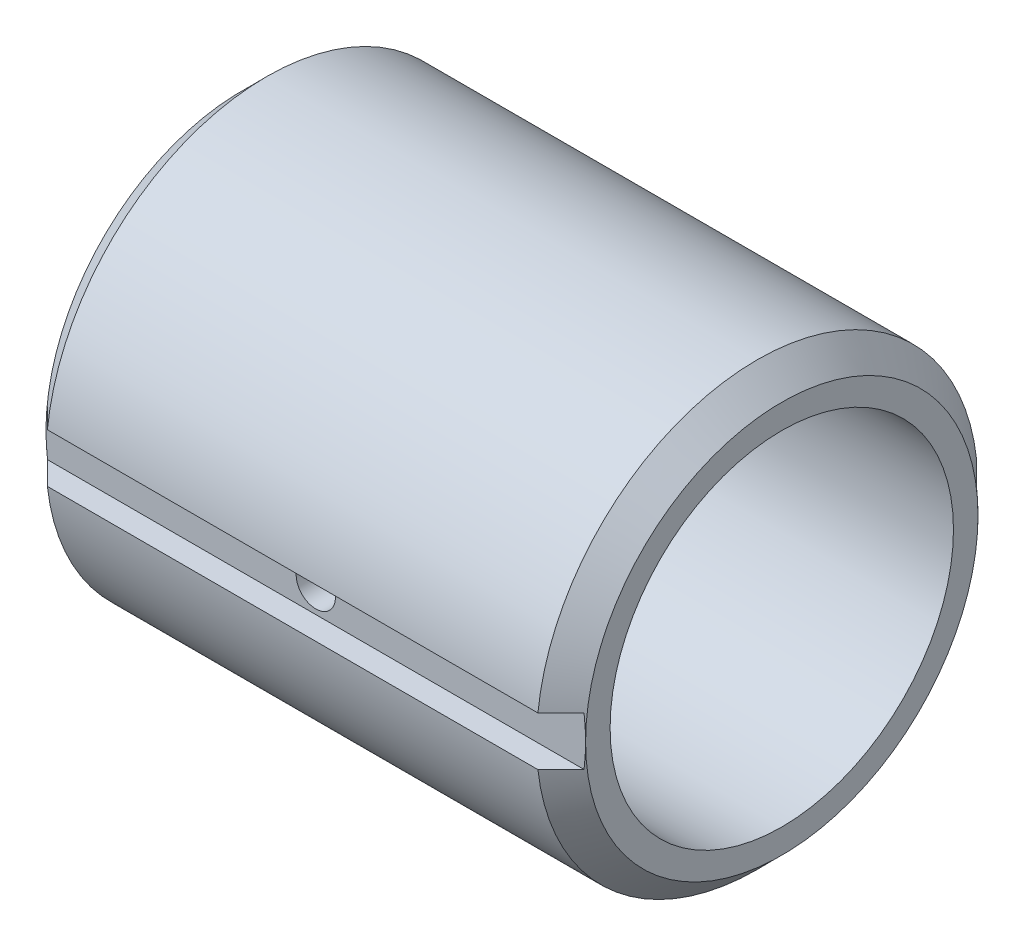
ISO-10303-21;
HEADER;
FILE_DESCRIPTION(('STEP AP214'),'2;1');
FILE_NAME('part.step','',(''),(''),'','','');
FILE_SCHEMA(('AUTOMOTIVE_DESIGN { 1 0 10303 214 1 1 1 1 }'));
ENDSEC;
DATA;
#1=APPLICATION_CONTEXT('core data for automotive mechanical design processes');
#2=APPLICATION_PROTOCOL_DEFINITION('international standard','automotive_design',2000,#1);
#3=PRODUCT_CONTEXT('',#1,'mechanical');
#4=PRODUCT('Part','Part','',(#3));
#5=PRODUCT_RELATED_PRODUCT_CATEGORY('part','',(#4));
#6=PRODUCT_DEFINITION_FORMATION('','',#4);
#7=PRODUCT_DEFINITION_CONTEXT('part definition',#1,'design');
#8=PRODUCT_DEFINITION('design','',#6,#7);
#9=PRODUCT_DEFINITION_SHAPE('','',#8);
#10=(LENGTH_UNIT() NAMED_UNIT(*) SI_UNIT(.MILLI.,.METRE.));
#11=(NAMED_UNIT(*) PLANE_ANGLE_UNIT() SI_UNIT($,.RADIAN.));
#12=(NAMED_UNIT(*) SI_UNIT($,.STERADIAN.) SOLID_ANGLE_UNIT());
#13=UNCERTAINTY_MEASURE_WITH_UNIT(LENGTH_MEASURE(1.E-05),#10,'distance_accuracy_value','');
#14=(GEOMETRIC_REPRESENTATION_CONTEXT(3) GLOBAL_UNCERTAINTY_ASSIGNED_CONTEXT((#13)) GLOBAL_UNIT_ASSIGNED_CONTEXT((#10,
#11,#12)) REPRESENTATION_CONTEXT('',''));
#15=CARTESIAN_POINT('',(0.,0.,0.));
#16=DIRECTION('',(0.,0.,1.));
#17=DIRECTION('',(1.,0.,0.));
#18=AXIS2_PLACEMENT_3D('',#15,#16,#17);
#19=CARTESIAN_POINT('',(-56.7094648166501,-29.0186818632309,0.));
#20=DIRECTION('',(1.,0.,0.));
#21=DIRECTION('',(0.,1.,0.));
#22=AXIS2_PLACEMENT_3D('',#19,#20,#21);
#23=CONICAL_SURFACE('',#22,57.15,0.785398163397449);
#24=CARTESIAN_POINT('',(-47.729008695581,-22.6686818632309,65.8248792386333));
#25=CARTESIAN_POINT('',(-49.7175826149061,-22.6686818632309,63.8270278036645));
#26=CARTESIAN_POINT('',(-51.7057811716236,-22.6686818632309,61.8288023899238));
#27=CARTESIAN_POINT('',(-55.6810500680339,-22.6686818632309,57.831232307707));
#28=CARTESIAN_POINT('',(-57.6681204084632,-22.6686818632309,55.8318876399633));
#29=CARTESIAN_POINT('',(-61.6407587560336,-22.6686818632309,51.8317043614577));
#30=CARTESIAN_POINT('',(-63.6263267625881,-22.6686818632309,49.8308657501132));
#31=CARTESIAN_POINT('',(-66.6030645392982,-22.6686818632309,46.8280062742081));
#32=CARTESIAN_POINT('',(-67.5950417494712,-22.6686818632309,45.826785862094));
#33=CARTESIAN_POINT('',(-69.5783330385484,-22.6686818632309,43.8236882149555));
#34=CARTESIAN_POINT('',(-70.5696471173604,-22.6686818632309,42.8218109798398));
#35=CARTESIAN_POINT('',(-71.5605670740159,-22.6686818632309,41.8195438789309));
#36=B_SPLINE_CURVE_WITH_KNOTS('',3,(#24,#25,#26,#27,#28,#29,#30,#31,#32,#33,#34,#35),
.UNSPECIFIED.,.F.,.F.,(4,2,2,2,2,4),(0.,8.45650841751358,16.9130113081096,25.3695174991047,
29.5977733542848,33.8260297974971),.UNSPECIFIED.);
#37=CARTESIAN_POINT('',(-56.7094648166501,-22.6686818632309,56.7961266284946));
#38=VERTEX_POINT('',#37);
#39=CARTESIAN_POINT('',(-62.6641281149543,-22.6686818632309,50.8));
#40=VERTEX_POINT('',#39);
#41=EDGE_CURVE('E257',#38,#40,#36,.T.);
#42=ORIENTED_EDGE('',*,*,#41,.F.);
#43=CARTESIAN_POINT('',(-56.7094648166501,-29.0186818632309,0.));
#44=DIRECTION('',(1.,0.,0.));
#45=DIRECTION('',(0.,1.,0.));
#46=AXIS2_PLACEMENT_3D('',#43,#44,#45);
#47=CIRCLE('',#46,57.15);
#48=CARTESIAN_POINT('',(-56.7094648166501,-22.6686818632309,-56.7961266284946));
#49=VERTEX_POINT('',#48);
#50=EDGE_CURVE('E148',#49,#38,#47,.T.);
#51=ORIENTED_EDGE('',*,*,#50,.F.);
#52=CARTESIAN_POINT('',(-71.5605670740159,-22.6686818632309,-41.8195438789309));
#53=CARTESIAN_POINT('',(-70.5696471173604,-22.6686818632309,-42.8218109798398));
#54=CARTESIAN_POINT('',(-69.5783330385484,-22.6686818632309,-43.8236882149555));
#55=CARTESIAN_POINT('',(-67.5950417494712,-22.6686818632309,-45.826785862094));
#56=CARTESIAN_POINT('',(-66.6030645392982,-22.6686818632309,-46.8280062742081));
#57=CARTESIAN_POINT('',(-63.6263267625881,-22.6686818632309,-49.8308657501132));
#58=CARTESIAN_POINT('',(-61.6407587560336,-22.6686818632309,-51.8317043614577));
#59=CARTESIAN_POINT('',(-57.6681204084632,-22.6686818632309,-55.8318876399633));
#60=CARTESIAN_POINT('',(-55.6810500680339,-22.6686818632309,-57.831232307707));
#61=CARTESIAN_POINT('',(-51.7057811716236,-22.6686818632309,-61.8288023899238));
#62=CARTESIAN_POINT('',(-49.7175826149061,-22.6686818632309,-63.8270278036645));
#63=CARTESIAN_POINT('',(-47.729008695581,-22.6686818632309,-65.8248792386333));
#64=B_SPLINE_CURVE_WITH_KNOTS('',3,(#52,#53,#54,#55,#56,#57,#58,#59,#60,#61,#62,#63),
.UNSPECIFIED.,.F.,.F.,(4,2,2,2,2,4),(0.,4.2282564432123,8.45651229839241,16.9130184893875,
25.3695213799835,33.8260297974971),.UNSPECIFIED.);
#65=CARTESIAN_POINT('',(-62.6641281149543,-22.6686818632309,-50.8));
#66=VERTEX_POINT('',#65);
#67=EDGE_CURVE('E137',#66,#49,#64,.T.);
#68=ORIENTED_EDGE('',*,*,#67,.F.);
#69=CARTESIAN_POINT('',(-59.0606425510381,-49.5679135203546,-50.8));
#70=CARTESIAN_POINT('',(-59.3683374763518,-48.7473884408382,-50.8));
#71=CARTESIAN_POINT('',(-59.6621813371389,-47.9215539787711,-50.8));
#72=CARTESIAN_POINT('',(-60.2193025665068,-46.2593389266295,-50.8));
#73=CARTESIAN_POINT('',(-60.4825693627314,-45.4229547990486,-50.8));
#74=CARTESIAN_POINT('',(-60.9760717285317,-43.7381767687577,-50.8));
#75=CARTESIAN_POINT('',(-61.2062231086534,-42.8897580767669,-50.8));
#76=CARTESIAN_POINT('',(-61.6296984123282,-41.1838379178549,-50.8));
#77=CARTESIAN_POINT('',(-61.8230262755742,-40.326337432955,-50.8));
#78=CARTESIAN_POINT('',(-62.1639644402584,-38.6336465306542,-50.8));
#79=CARTESIAN_POINT('',(-62.3129441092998,-37.7987328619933,-50.8));
#80=CARTESIAN_POINT('',(-62.571810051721,-36.1228256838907,-50.8));
#81=CARTESIAN_POINT('',(-62.6816957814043,-35.2818320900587,-50.8));
#82=CARTESIAN_POINT('',(-62.8604880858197,-33.5965360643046,-50.8));
#83=CARTESIAN_POINT('',(-62.9294454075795,-32.7522390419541,-50.8));
#84=CARTESIAN_POINT('',(-63.0254252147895,-31.061257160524,-50.8));
#85=CARTESIAN_POINT('',(-63.0524477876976,-30.2145723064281,-50.8));
#86=CARTESIAN_POINT('',(-63.0642758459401,-28.4928981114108,-50.8));
#87=CARTESIAN_POINT('',(-63.0476558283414,-27.6178985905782,-50.8));
#88=CARTESIAN_POINT('',(-62.969462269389,-25.8699080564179,-50.8));
#89=CARTESIAN_POINT('',(-62.9078878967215,-24.9969170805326,-50.8));
#90=CARTESIAN_POINT('',(-62.7407976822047,-23.2539905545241,-50.8));
#91=CARTESIAN_POINT('',(-62.6352230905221,-22.384060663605,-50.8));
#92=CARTESIAN_POINT('',(-62.3819682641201,-20.6504018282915,-50.8));
#93=CARTESIAN_POINT('',(-62.2342888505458,-19.7866727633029,-50.8));
#94=CARTESIAN_POINT('',(-61.8928995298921,-18.0346115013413,-50.8));
#95=CARTESIAN_POINT('',(-61.6976659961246,-17.1465772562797,-50.8));
#96=CARTESIAN_POINT('',(-61.2674829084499,-15.3801107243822,-50.8));
#97=CARTESIAN_POINT('',(-61.0325285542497,-14.5016796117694,-50.8));
#98=CARTESIAN_POINT('',(-60.5268806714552,-12.7577085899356,-50.8));
#99=CARTESIAN_POINT('',(-60.2562819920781,-11.8921410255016,-50.8));
#100=CARTESIAN_POINT('',(-59.6822657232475,-10.1723061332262,-50.8));
#101=CARTESIAN_POINT('',(-59.3788607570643,-9.31803459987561,-50.8));
#102=CARTESIAN_POINT('',(-59.0606425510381,-8.46945020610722,-50.8));
#103=B_SPLINE_CURVE_WITH_KNOTS('',3,(#69,#70,#71,#72,#73,#74,#75,#76,#77,#78,#79,#80,#81,#82,
#83,#84,#85,#86,#87,#88,#89,#90,#91,#92,#93,#94,#95,#96,#97,#98,#99,#100,#101,#102),
.UNSPECIFIED.,.F.,.F.,(4,2,2,2,2,2,2,2,2,2,2,2,2,2,2,2,4),(0.,2.628996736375,5.25889978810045,
7.89537499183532,10.5315679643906,13.0749956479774,15.6184587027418,18.1587615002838,
20.6990589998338,23.3233543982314,25.9476983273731,28.5755576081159,31.2033656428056,
33.9301044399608,36.657173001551,39.3771261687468,42.0960364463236),.UNSPECIFIED.);
#104=CARTESIAN_POINT('',(-63.0594648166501,-29.0186818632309,-50.8));
#105=VERTEX_POINT('',#104);
#106=EDGE_CURVE('E122',#105,#66,#103,.T.);
#107=ORIENTED_EDGE('',*,*,#106,.F.);
#108=CARTESIAN_POINT('',(-63.0594648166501,-29.0186818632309,0.));
#109=DIRECTION('',(1.,0.,0.));
#110=DIRECTION('',(0.,1.,0.));
#111=AXIS2_PLACEMENT_3D('',#108,#109,#110);
#112=CIRCLE('',#111,50.8);
#113=CARTESIAN_POINT('',(-63.0594648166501,-29.0186818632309,50.8));
#114=VERTEX_POINT('',#113);
#115=EDGE_CURVE('E279',#105,#114,#112,.T.);
#116=ORIENTED_EDGE('',*,*,#115,.T.);
#117=CARTESIAN_POINT('',(-59.0606425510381,-8.4694502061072,50.8));
#118=CARTESIAN_POINT('',(-59.3683374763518,-9.2899752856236,50.8));
#119=CARTESIAN_POINT('',(-59.6621813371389,-10.1158097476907,50.8));
#120=CARTESIAN_POINT('',(-60.2193025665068,-11.7780247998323,50.8));
#121=CARTESIAN_POINT('',(-60.4825693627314,-12.6144089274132,50.8));
#122=CARTESIAN_POINT('',(-60.9760717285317,-14.2991869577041,50.8));
#123=CARTESIAN_POINT('',(-61.2062231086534,-15.1476056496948,50.8));
#124=CARTESIAN_POINT('',(-61.6296984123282,-16.8535258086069,50.8));
#125=CARTESIAN_POINT('',(-61.8230262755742,-17.7110262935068,50.8));
#126=CARTESIAN_POINT('',(-62.1639644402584,-19.4037171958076,50.8));
#127=CARTESIAN_POINT('',(-62.3129441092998,-20.2386308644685,50.8));
#128=CARTESIAN_POINT('',(-62.571810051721,-21.9145380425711,50.8));
#129=CARTESIAN_POINT('',(-62.6816957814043,-22.7555316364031,50.8));
#130=CARTESIAN_POINT('',(-62.8604880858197,-24.4408276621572,50.8));
#131=CARTESIAN_POINT('',(-62.9294454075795,-25.2851246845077,50.8));
#132=CARTESIAN_POINT('',(-63.0254252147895,-26.9761065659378,50.8));
#133=CARTESIAN_POINT('',(-63.0524477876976,-27.8227914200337,50.8));
#134=CARTESIAN_POINT('',(-63.0642758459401,-29.544465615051,50.8));
#135=CARTESIAN_POINT('',(-63.0476558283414,-30.4194651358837,50.8));
#136=CARTESIAN_POINT('',(-62.969462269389,-32.1674556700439,50.8));
#137=CARTESIAN_POINT('',(-62.9078878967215,-33.0404466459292,50.8));
#138=CARTESIAN_POINT('',(-62.7407976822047,-34.7833731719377,50.8));
#139=CARTESIAN_POINT('',(-62.6352230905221,-35.6533030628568,50.8));
#140=CARTESIAN_POINT('',(-62.3819682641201,-37.3869618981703,50.8));
#141=CARTESIAN_POINT('',(-62.2342888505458,-38.2506909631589,50.8));
#142=CARTESIAN_POINT('',(-61.8928995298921,-40.0027522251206,50.8));
#143=CARTESIAN_POINT('',(-61.6976659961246,-40.8907864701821,50.8));
#144=CARTESIAN_POINT('',(-61.2674829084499,-42.6572530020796,50.8));
#145=CARTESIAN_POINT('',(-61.0325285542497,-43.5356841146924,50.8));
#146=CARTESIAN_POINT('',(-60.5268806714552,-45.2796551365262,50.8));
#147=CARTESIAN_POINT('',(-60.2562819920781,-46.1452227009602,50.8));
#148=CARTESIAN_POINT('',(-59.6822657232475,-47.8650575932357,50.8));
#149=CARTESIAN_POINT('',(-59.3788607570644,-48.7193291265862,50.8));
#150=CARTESIAN_POINT('',(-59.0606425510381,-49.5679135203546,50.8));
#151=B_SPLINE_CURVE_WITH_KNOTS('',3,(#117,#118,#119,#120,#121,#122,#123,#124,#125,#126,#127,
#128,#129,#130,#131,#132,#133,#134,#135,#136,#137,#138,#139,#140,#141,#142,#143,#144,#145,#146,
#147,#148,#149,#150),.UNSPECIFIED.,.F.,.F.,(4,2,2,2,2,2,2,2,2,2,2,2,2,2,2,2,4),(0.,
2.62899673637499,5.25889978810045,7.89537499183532,10.5315679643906,13.0749956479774,
15.6184587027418,18.1587615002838,20.6990589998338,23.3233543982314,25.9476983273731,
28.5755576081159,31.2033656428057,33.9301044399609,36.657173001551,39.3771261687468,
42.0960364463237),.UNSPECIFIED.);
#152=EDGE_CURVE('E300',#40,#114,#151,.T.);
#153=ORIENTED_EDGE('',*,*,#152,.F.);
#154=EDGE_LOOP('',(#42,#51,#68,#107,#116,#153));
#155=FACE_BOUND('',#154,.T.);
#156=ADVANCED_FACE('F39',(#155),#23,.T.);
#157=CARTESIAN_POINT('',(76.6405351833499,-29.0186818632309,0.));
#158=DIRECTION('',(1.,0.,0.));
#159=DIRECTION('',(0.,1.,0.));
#160=AXIS2_PLACEMENT_3D('',#157,#158,#159);
#161=CYLINDRICAL_SURFACE('',#160,57.15);
#162=DIRECTION('',(1.,0.,0.));
#163=VECTOR('',#162,1.);
#164=CARTESIAN_POINT('',(76.6405351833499,-22.6686818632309,56.7961266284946));
#165=LINE('',#164,#163);
#166=CARTESIAN_POINT('',(70.2905351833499,-22.6686818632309,56.7961266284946));
#167=VERTEX_POINT('',#166);
#168=EDGE_CURVE('E254',#167,#38,#165,.F.);
#169=ORIENTED_EDGE('',*,*,#168,.F.);
#170=CARTESIAN_POINT('',(70.2905351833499,-29.0186818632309,0.));
#171=DIRECTION('',(1.,0.,0.));
#172=DIRECTION('',(0.,1.,0.));
#173=AXIS2_PLACEMENT_3D('',#170,#171,#172);
#174=CIRCLE('',#173,57.15);
#175=CARTESIAN_POINT('',(70.2905351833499,-22.6686818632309,-56.7961266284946));
#176=VERTEX_POINT('',#175);
#177=EDGE_CURVE('E269',#176,#167,#174,.T.);
#178=ORIENTED_EDGE('',*,*,#177,.F.);
#179=DIRECTION('',(1.,0.,0.));
#180=VECTOR('',#179,1.);
#181=CARTESIAN_POINT('',(76.6405351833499,-22.6686818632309,-56.7961266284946));
#182=LINE('',#181,#180);
#183=EDGE_CURVE('E150',#49,#176,#182,.T.);
#184=ORIENTED_EDGE('',*,*,#183,.F.);
#185=ORIENTED_EDGE('',*,*,#50,.T.);
#186=EDGE_LOOP('',(#169,#178,#184,#185));
#187=FACE_BOUND('',#186,.T.);
#188=ADVANCED_FACE('F313',(#187),#161,.T.);
#189=CARTESIAN_POINT('',(76.6405351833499,-29.0186818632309,0.));
#190=DIRECTION('',(-1.,0.,0.));
#191=DIRECTION('',(0.,-1.,0.));
#192=AXIS2_PLACEMENT_3D('',#189,#190,#191);
#193=CONICAL_SURFACE('',#192,50.8,0.785398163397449);
#194=CARTESIAN_POINT('',(85.1416374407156,-22.6686818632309,41.8195438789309));
#195=CARTESIAN_POINT('',(84.1507174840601,-22.6686818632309,42.8218109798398));
#196=CARTESIAN_POINT('',(83.1594034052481,-22.6686818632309,43.8236882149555));
#197=CARTESIAN_POINT('',(81.1761121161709,-22.6686818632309,45.826785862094));
#198=CARTESIAN_POINT('',(80.1841349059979,-22.6686818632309,46.8280062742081));
#199=CARTESIAN_POINT('',(77.2073971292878,-22.6686818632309,49.8308657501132));
#200=CARTESIAN_POINT('',(75.2218291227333,-22.6686818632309,51.8317043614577));
#201=CARTESIAN_POINT('',(71.2491907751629,-22.6686818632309,55.8318876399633));
#202=CARTESIAN_POINT('',(69.2621204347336,-22.6686818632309,57.831232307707));
#203=CARTESIAN_POINT('',(65.2868515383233,-22.6686818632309,61.8288023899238));
#204=CARTESIAN_POINT('',(63.2986529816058,-22.6686818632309,63.8270278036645));
#205=CARTESIAN_POINT('',(61.3100790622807,-22.6686818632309,65.8248792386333));
#206=B_SPLINE_CURVE_WITH_KNOTS('',3,(#194,#195,#196,#197,#198,#199,#200,#201,#202,#203,#204,
#205),.UNSPECIFIED.,.F.,.F.,(4,2,2,2,2,4),(0.,4.2282564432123,8.45651229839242,16.9130184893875,
25.3695213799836,33.8260297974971),.UNSPECIFIED.);
#207=CARTESIAN_POINT('',(76.245198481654,-22.6686818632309,50.8));
#208=VERTEX_POINT('',#207);
#209=EDGE_CURVE('E11',#208,#167,#206,.T.);
#210=ORIENTED_EDGE('',*,*,#209,.F.);
#211=CARTESIAN_POINT('',(72.6417129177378,-49.5679135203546,50.8));
#212=CARTESIAN_POINT('',(72.9494078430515,-48.7473884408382,50.8));
#213=CARTESIAN_POINT('',(73.2432517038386,-47.9215539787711,50.8));
#214=CARTESIAN_POINT('',(73.8003729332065,-46.2593389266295,50.8));
#215=CARTESIAN_POINT('',(74.0636397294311,-45.4229547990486,50.8));
#216=CARTESIAN_POINT('',(74.5571420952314,-43.7381767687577,50.8));
#217=CARTESIAN_POINT('',(74.7872934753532,-42.889758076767,50.8));
#218=CARTESIAN_POINT('',(75.2107687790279,-41.1838379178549,50.8));
#219=CARTESIAN_POINT('',(75.4040966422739,-40.326337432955,50.8));
#220=CARTESIAN_POINT('',(75.7450348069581,-38.6336465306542,50.8));
#221=CARTESIAN_POINT('',(75.8940144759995,-37.7987328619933,50.8));
#222=CARTESIAN_POINT('',(76.1528804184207,-36.1228256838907,50.8));
#223=CARTESIAN_POINT('',(76.262766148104,-35.2818320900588,50.8));
#224=CARTESIAN_POINT('',(76.4415584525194,-33.5965360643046,50.8));
#225=CARTESIAN_POINT('',(76.5105157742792,-32.7522390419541,50.8));
#226=CARTESIAN_POINT('',(76.6064955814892,-31.061257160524,50.8));
#227=CARTESIAN_POINT('',(76.6335181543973,-30.2145723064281,50.8));
#228=CARTESIAN_POINT('',(76.6453462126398,-28.4928981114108,50.8));
#229=CARTESIAN_POINT('',(76.6287261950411,-27.6178985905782,50.8));
#230=CARTESIAN_POINT('',(76.5505326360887,-25.8699080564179,50.8));
#231=CARTESIAN_POINT('',(76.4889582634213,-24.9969170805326,50.8));
#232=CARTESIAN_POINT('',(76.3218680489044,-23.2539905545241,50.8));
#233=CARTESIAN_POINT('',(76.2162934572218,-22.384060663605,50.8));
#234=CARTESIAN_POINT('',(75.9630386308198,-20.6504018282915,50.8));
#235=CARTESIAN_POINT('',(75.8153592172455,-19.7866727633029,50.8));
#236=CARTESIAN_POINT('',(75.4739698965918,-18.0346115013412,50.8));
#237=CARTESIAN_POINT('',(75.2787363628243,-17.1465772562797,50.8));
#238=CARTESIAN_POINT('',(74.8485532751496,-15.3801107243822,50.8));
#239=CARTESIAN_POINT('',(74.6135989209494,-14.5016796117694,50.8));
#240=CARTESIAN_POINT('',(74.1079510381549,-12.7577085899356,50.8));
#241=CARTESIAN_POINT('',(73.8373523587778,-11.8921410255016,50.8));
#242=CARTESIAN_POINT('',(73.2633360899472,-10.1723061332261,50.8));
#243=CARTESIAN_POINT('',(72.9599311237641,-9.3180345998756,50.8));
#244=CARTESIAN_POINT('',(72.6417129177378,-8.4694502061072,50.8));
#245=B_SPLINE_CURVE_WITH_KNOTS('',3,(#211,#212,#213,#214,#215,#216,#217,#218,#219,#220,#221,
#222,#223,#224,#225,#226,#227,#228,#229,#230,#231,#232,#233,#234,#235,#236,#237,#238,#239,#240,
#241,#242,#243,#244),.UNSPECIFIED.,.F.,.F.,(4,2,2,2,2,2,2,2,2,2,2,2,2,2,2,2,4),(0.,
2.628996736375,5.25889978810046,7.89537499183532,10.5315679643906,13.0749956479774,
15.6184587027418,18.1587615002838,20.6990589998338,23.3233543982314,25.9476983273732,
28.575557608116,31.2033656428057,33.9301044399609,36.657173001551,39.3771261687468,
42.0960364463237),.UNSPECIFIED.);
#246=CARTESIAN_POINT('',(76.6405351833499,-29.0186818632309,50.8));
#247=VERTEX_POINT('',#246);
#248=EDGE_CURVE('E214',#247,#208,#245,.T.);
#249=ORIENTED_EDGE('',*,*,#248,.F.);
#250=CARTESIAN_POINT('',(76.6405351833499,-29.0186818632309,0.));
#251=DIRECTION('',(1.,0.,0.));
#252=DIRECTION('',(0.,1.,0.));
#253=AXIS2_PLACEMENT_3D('',#250,#251,#252);
#254=CIRCLE('',#253,50.8);
#255=CARTESIAN_POINT('',(76.6405351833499,-29.0186818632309,-50.8));
#256=VERTEX_POINT('',#255);
#257=EDGE_CURVE('E264',#256,#247,#254,.T.);
#258=ORIENTED_EDGE('',*,*,#257,.F.);
#259=CARTESIAN_POINT('',(72.6417129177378,-8.46945020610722,-50.8));
#260=CARTESIAN_POINT('',(72.9494078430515,-9.28997528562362,-50.8));
#261=CARTESIAN_POINT('',(73.2432517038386,-10.1158097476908,-50.8));
#262=CARTESIAN_POINT('',(73.8003729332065,-11.7780247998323,-50.8));
#263=CARTESIAN_POINT('',(74.0636397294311,-12.6144089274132,-50.8));
#264=CARTESIAN_POINT('',(74.5571420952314,-14.2991869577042,-50.8));
#265=CARTESIAN_POINT('',(74.7872934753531,-15.1476056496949,-50.8));
#266=CARTESIAN_POINT('',(75.2107687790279,-16.8535258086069,-50.8));
#267=CARTESIAN_POINT('',(75.4040966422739,-17.7110262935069,-50.8));
#268=CARTESIAN_POINT('',(75.7450348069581,-19.4037171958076,-50.8));
#269=CARTESIAN_POINT('',(75.8940144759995,-20.2386308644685,-50.8));
#270=CARTESIAN_POINT('',(76.1528804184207,-21.9145380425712,-50.8));
#271=CARTESIAN_POINT('',(76.262766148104,-22.7555316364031,-50.8));
#272=CARTESIAN_POINT('',(76.4415584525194,-24.4408276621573,-50.8));
#273=CARTESIAN_POINT('',(76.5105157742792,-25.2851246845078,-50.8));
#274=CARTESIAN_POINT('',(76.6064955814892,-26.9761065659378,-50.8));
#275=CARTESIAN_POINT('',(76.6335181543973,-27.8227914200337,-50.8));
#276=CARTESIAN_POINT('',(76.6453462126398,-29.5444656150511,-50.8));
#277=CARTESIAN_POINT('',(76.6287261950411,-30.4194651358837,-50.8));
#278=CARTESIAN_POINT('',(76.5505326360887,-32.1674556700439,-50.8));
#279=CARTESIAN_POINT('',(76.4889582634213,-33.0404466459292,-50.8));
#280=CARTESIAN_POINT('',(76.3218680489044,-34.7833731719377,-50.8));
#281=CARTESIAN_POINT('',(76.2162934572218,-35.6533030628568,-50.8));
#282=CARTESIAN_POINT('',(75.9630386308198,-37.3869618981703,-50.8));
#283=CARTESIAN_POINT('',(75.8153592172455,-38.2506909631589,-50.8));
#284=CARTESIAN_POINT('',(75.4739698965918,-40.0027522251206,-50.8));
#285=CARTESIAN_POINT('',(75.2787363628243,-40.8907864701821,-50.8));
#286=CARTESIAN_POINT('',(74.8485532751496,-42.6572530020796,-50.8));
#287=CARTESIAN_POINT('',(74.6135989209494,-43.5356841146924,-50.8));
#288=CARTESIAN_POINT('',(74.1079510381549,-45.2796551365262,-50.8));
#289=CARTESIAN_POINT('',(73.8373523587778,-46.1452227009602,-50.8));
#290=CARTESIAN_POINT('',(73.2633360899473,-47.8650575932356,-50.8));
#291=CARTESIAN_POINT('',(72.9599311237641,-48.7193291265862,-50.8));
#292=CARTESIAN_POINT('',(72.6417129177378,-49.5679135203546,-50.8));
#293=B_SPLINE_CURVE_WITH_KNOTS('',3,(#259,#260,#261,#262,#263,#264,#265,#266,#267,#268,#269,
#270,#271,#272,#273,#274,#275,#276,#277,#278,#279,#280,#281,#282,#283,#284,#285,#286,#287,#288,
#289,#290,#291,#292),.UNSPECIFIED.,.F.,.F.,(4,2,2,2,2,2,2,2,2,2,2,2,2,2,2,2,4),(0.,
2.62899673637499,5.25889978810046,7.89537499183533,10.5315679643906,13.0749956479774,
15.6184587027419,18.1587615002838,20.6990589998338,23.3233543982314,25.9476983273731,
28.5755576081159,31.2033656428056,33.9301044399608,36.657173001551,39.3771261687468,
42.0960364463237),.UNSPECIFIED.);
#294=CARTESIAN_POINT('',(76.245198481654,-22.6686818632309,-50.8));
#295=VERTEX_POINT('',#294);
#296=EDGE_CURVE('E70',#295,#256,#293,.T.);
#297=ORIENTED_EDGE('',*,*,#296,.F.);
#298=CARTESIAN_POINT('',(61.3100790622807,-22.6686818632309,-65.8248792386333));
#299=CARTESIAN_POINT('',(63.2986529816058,-22.6686818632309,-63.8270278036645));
#300=CARTESIAN_POINT('',(65.2868515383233,-22.6686818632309,-61.8288023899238));
#301=CARTESIAN_POINT('',(69.2621204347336,-22.6686818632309,-57.831232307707));
#302=CARTESIAN_POINT('',(71.2491907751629,-22.6686818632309,-55.8318876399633));
#303=CARTESIAN_POINT('',(75.2218291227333,-22.6686818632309,-51.8317043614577));
#304=CARTESIAN_POINT('',(77.2073971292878,-22.6686818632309,-49.8308657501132));
#305=CARTESIAN_POINT('',(80.1841349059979,-22.6686818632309,-46.8280062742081));
#306=CARTESIAN_POINT('',(81.1761121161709,-22.6686818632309,-45.826785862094));
#307=CARTESIAN_POINT('',(83.1594034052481,-22.6686818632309,-43.8236882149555));
#308=CARTESIAN_POINT('',(84.1507174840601,-22.6686818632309,-42.8218109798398));
#309=CARTESIAN_POINT('',(85.1416374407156,-22.6686818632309,-41.8195438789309));
#310=B_SPLINE_CURVE_WITH_KNOTS('',3,(#298,#299,#300,#301,#302,#303,#304,#305,#306,#307,#308,
#309),.UNSPECIFIED.,.F.,.F.,(4,2,2,2,2,4),(0.,8.45650841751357,16.9130113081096,
25.3695174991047,29.5977733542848,33.8260297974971),.UNSPECIFIED.);
#311=EDGE_CURVE('E140',#176,#295,#310,.T.);
#312=ORIENTED_EDGE('',*,*,#311,.F.);
#313=ORIENTED_EDGE('',*,*,#177,.T.);
#314=EDGE_LOOP('',(#210,#249,#258,#297,#312,#313));
#315=FACE_BOUND('',#314,.T.);
#316=ADVANCED_FACE('F202',(#315),#193,.T.);
#317=CARTESIAN_POINT('',(-63.0594648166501,-29.0186818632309,0.));
#318=DIRECTION('',(-1.,0.,0.));
#319=DIRECTION('',(0.,-1.,0.));
#320=AXIS2_PLACEMENT_3D('',#317,#318,#319);
#321=PLANE('',#320);
#322=CARTESIAN_POINT('',(-63.0594648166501,-29.0186818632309,0.));
#323=DIRECTION('',(-1.,0.,0.));
#324=DIRECTION('',(0.,-1.,0.));
#325=AXIS2_PLACEMENT_3D('',#322,#323,#324);
#326=CIRCLE('',#325,44.45);
#327=CARTESIAN_POINT('',(-63.0594648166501,-73.4686818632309,0.));
#328=VERTEX_POINT('',#327);
#329=EDGE_CURVE('E143',#328,#328,#326,.T.);
#330=ORIENTED_EDGE('',*,*,#329,.F.);
#331=EDGE_LOOP('',(#330));
#332=FACE_BOUND('',#331,.T.);
#333=EDGE_CURVE('E276',#114,#105,#112,.T.);
#334=ORIENTED_EDGE('',*,*,#333,.F.);
#335=ORIENTED_EDGE('',*,*,#115,.F.);
#336=EDGE_LOOP('',(#334,#335));
#337=FACE_BOUND('',#336,.T.);
#338=ADVANCED_FACE('F41',(#332,#337),#321,.T.);
#339=CARTESIAN_POINT('',(-62.6641281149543,-35.3686818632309,50.8));
#340=VERTEX_POINT('',#339);
#341=EDGE_CURVE('E228',#114,#340,#151,.T.);
#342=ORIENTED_EDGE('',*,*,#341,.F.);
#343=ORIENTED_EDGE('',*,*,#333,.T.);
#344=CARTESIAN_POINT('',(-62.6641281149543,-35.3686818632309,-50.8));
#345=VERTEX_POINT('',#344);
#346=EDGE_CURVE('E128',#345,#105,#103,.T.);
#347=ORIENTED_EDGE('',*,*,#346,.F.);
#348=CARTESIAN_POINT('',(-47.729008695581,-35.3686818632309,-65.8248792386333));
#349=CARTESIAN_POINT('',(-49.7175826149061,-35.3686818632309,-63.8270278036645));
#350=CARTESIAN_POINT('',(-51.7057811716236,-35.3686818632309,-61.8288023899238));
#351=CARTESIAN_POINT('',(-55.6810500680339,-35.3686818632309,-57.8312323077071));
#352=CARTESIAN_POINT('',(-57.6681204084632,-35.3686818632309,-55.8318876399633));
#353=CARTESIAN_POINT('',(-61.6407587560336,-35.3686818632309,-51.8317043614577));
#354=CARTESIAN_POINT('',(-63.6263267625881,-35.3686818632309,-49.8308657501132));
#355=CARTESIAN_POINT('',(-66.6030645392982,-35.3686818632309,-46.8280062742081));
#356=CARTESIAN_POINT('',(-67.5950417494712,-35.3686818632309,-45.826785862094));
#357=CARTESIAN_POINT('',(-69.5783330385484,-35.3686818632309,-43.8236882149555));
#358=CARTESIAN_POINT('',(-70.5696471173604,-35.3686818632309,-42.8218109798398));
#359=CARTESIAN_POINT('',(-71.5605670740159,-35.3686818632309,-41.8195438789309));
#360=B_SPLINE_CURVE_WITH_KNOTS('',3,(#348,#349,#350,#351,#352,#353,#354,#355,#356,#357,#358,
#359),.UNSPECIFIED.,.F.,.F.,(4,2,2,2,2,4),(0.,8.45650841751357,16.9130113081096,
25.3695174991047,29.5977733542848,33.8260297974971),.UNSPECIFIED.);
#361=CARTESIAN_POINT('',(-56.7094648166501,-35.3686818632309,-56.7961266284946));
#362=VERTEX_POINT('',#361);
#363=EDGE_CURVE('E156',#362,#345,#360,.T.);
#364=ORIENTED_EDGE('',*,*,#363,.F.);
#365=CARTESIAN_POINT('',(-56.7094648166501,-35.3686818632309,56.7961266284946));
#366=VERTEX_POINT('',#365);
#367=EDGE_CURVE('E275',#366,#362,#47,.T.);
#368=ORIENTED_EDGE('',*,*,#367,.F.);
#369=CARTESIAN_POINT('',(-71.5605670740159,-35.3686818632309,41.8195438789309));
#370=CARTESIAN_POINT('',(-70.5696471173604,-35.3686818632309,42.8218109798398));
#371=CARTESIAN_POINT('',(-69.5783330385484,-35.3686818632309,43.8236882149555));
#372=CARTESIAN_POINT('',(-67.5950417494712,-35.3686818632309,45.826785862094));
#373=CARTESIAN_POINT('',(-66.6030645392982,-35.3686818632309,46.8280062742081));
#374=CARTESIAN_POINT('',(-63.6263267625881,-35.3686818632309,49.8308657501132));
#375=CARTESIAN_POINT('',(-61.6407587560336,-35.3686818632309,51.8317043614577));
#376=CARTESIAN_POINT('',(-57.6681204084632,-35.3686818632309,55.8318876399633));
#377=CARTESIAN_POINT('',(-55.6810500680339,-35.3686818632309,57.831232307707));
#378=CARTESIAN_POINT('',(-51.7057811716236,-35.3686818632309,61.8288023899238));
#379=CARTESIAN_POINT('',(-49.7175826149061,-35.3686818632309,63.8270278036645));
#380=CARTESIAN_POINT('',(-47.729008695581,-35.3686818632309,65.8248792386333));
#381=B_SPLINE_CURVE_WITH_KNOTS('',3,(#369,#370,#371,#372,#373,#374,#375,#376,#377,#378,#379,
#380),.UNSPECIFIED.,.F.,.F.,(4,2,2,2,2,4),(0.,4.2282564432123,8.45651229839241,16.9130184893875,
25.3695213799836,33.8260297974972),.UNSPECIFIED.);
#382=EDGE_CURVE('E154',#340,#366,#381,.T.);
#383=ORIENTED_EDGE('',*,*,#382,.F.);
#384=EDGE_LOOP('',(#342,#343,#347,#364,#368,#383));
#385=FACE_BOUND('',#384,.T.);
#386=ADVANCED_FACE('F165',(#385),#23,.T.);
#387=DIRECTION('',(1.,0.,0.));
#388=VECTOR('',#387,1.);
#389=CARTESIAN_POINT('',(76.6405351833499,-35.3686818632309,56.7961266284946));
#390=LINE('',#389,#388);
#391=CARTESIAN_POINT('',(70.2905351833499,-35.3686818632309,56.7961266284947));
#392=VERTEX_POINT('',#391);
#393=EDGE_CURVE('E62',#366,#392,#390,.T.);
#394=ORIENTED_EDGE('',*,*,#393,.F.);
#395=ORIENTED_EDGE('',*,*,#367,.T.);
#396=DIRECTION('',(1.,0.,0.));
#397=VECTOR('',#396,1.);
#398=CARTESIAN_POINT('',(76.6405351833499,-35.3686818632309,-56.7961266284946));
#399=LINE('',#398,#397);
#400=CARTESIAN_POINT('',(70.2905351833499,-35.3686818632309,-56.7961266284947));
#401=VERTEX_POINT('',#400);
#402=EDGE_CURVE('E292',#401,#362,#399,.F.);
#403=ORIENTED_EDGE('',*,*,#402,.F.);
#404=EDGE_CURVE('E273',#392,#401,#174,.T.);
#405=ORIENTED_EDGE('',*,*,#404,.F.);
#406=EDGE_LOOP('',(#394,#395,#403,#405));
#407=FACE_BOUND('',#406,.T.);
#408=ADVANCED_FACE('F200',(#407),#161,.T.);
#409=CARTESIAN_POINT('',(76.245198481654,-35.3686818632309,50.8));
#410=VERTEX_POINT('',#409);
#411=EDGE_CURVE('E223',#410,#247,#245,.T.);
#412=ORIENTED_EDGE('',*,*,#411,.F.);
#413=CARTESIAN_POINT('',(61.3100790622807,-35.3686818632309,65.8248792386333));
#414=CARTESIAN_POINT('',(63.2986529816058,-35.3686818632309,63.8270278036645));
#415=CARTESIAN_POINT('',(65.2868515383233,-35.3686818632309,61.8288023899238));
#416=CARTESIAN_POINT('',(69.2621204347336,-35.3686818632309,57.8312323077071));
#417=CARTESIAN_POINT('',(71.2491907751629,-35.3686818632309,55.8318876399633));
#418=CARTESIAN_POINT('',(75.2218291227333,-35.3686818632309,51.8317043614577));
#419=CARTESIAN_POINT('',(77.2073971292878,-35.3686818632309,49.8308657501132));
#420=CARTESIAN_POINT('',(80.1841349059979,-35.3686818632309,46.8280062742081));
#421=CARTESIAN_POINT('',(81.1761121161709,-35.3686818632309,45.826785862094));
#422=CARTESIAN_POINT('',(83.1594034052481,-35.3686818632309,43.8236882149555));
#423=CARTESIAN_POINT('',(84.1507174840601,-35.3686818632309,42.8218109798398));
#424=CARTESIAN_POINT('',(85.1416374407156,-35.3686818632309,41.8195438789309));
#425=B_SPLINE_CURVE_WITH_KNOTS('',3,(#413,#414,#415,#416,#417,#418,#419,#420,#421,#422,#423,
#424),.UNSPECIFIED.,.F.,.F.,(4,2,2,2,2,4),(0.,8.45650841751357,16.9130113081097,
25.3695174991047,29.5977733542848,33.8260297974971),.UNSPECIFIED.);
#426=EDGE_CURVE('E54',#392,#410,#425,.T.);
#427=ORIENTED_EDGE('',*,*,#426,.F.);
#428=ORIENTED_EDGE('',*,*,#404,.T.);
#429=CARTESIAN_POINT('',(85.1416374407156,-35.3686818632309,-41.8195438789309));
#430=CARTESIAN_POINT('',(84.1507174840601,-35.3686818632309,-42.8218109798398));
#431=CARTESIAN_POINT('',(83.1594034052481,-35.3686818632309,-43.8236882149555));
#432=CARTESIAN_POINT('',(81.1761121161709,-35.3686818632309,-45.826785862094));
#433=CARTESIAN_POINT('',(80.1841349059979,-35.3686818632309,-46.8280062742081));
#434=CARTESIAN_POINT('',(77.2073971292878,-35.3686818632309,-49.8308657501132));
#435=CARTESIAN_POINT('',(75.2218291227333,-35.3686818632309,-51.8317043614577));
#436=CARTESIAN_POINT('',(71.2491907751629,-35.3686818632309,-55.8318876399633));
#437=CARTESIAN_POINT('',(69.2621204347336,-35.3686818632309,-57.8312323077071));
#438=CARTESIAN_POINT('',(65.2868515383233,-35.3686818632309,-61.8288023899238));
#439=CARTESIAN_POINT('',(63.2986529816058,-35.3686818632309,-63.8270278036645));
#440=CARTESIAN_POINT('',(61.3100790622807,-35.3686818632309,-65.8248792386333));
#441=B_SPLINE_CURVE_WITH_KNOTS('',3,(#429,#430,#431,#432,#433,#434,#435,#436,#437,#438,#439,
#440),.UNSPECIFIED.,.F.,.F.,(4,2,2,2,2,4),(0.,4.22825644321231,8.45651229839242,
16.9130184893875,25.3695213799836,33.8260297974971),.UNSPECIFIED.);
#442=CARTESIAN_POINT('',(76.245198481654,-35.3686818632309,-50.8));
#443=VERTEX_POINT('',#442);
#444=EDGE_CURVE('E186',#443,#401,#441,.T.);
#445=ORIENTED_EDGE('',*,*,#444,.F.);
#446=EDGE_CURVE('E206',#256,#443,#293,.T.);
#447=ORIENTED_EDGE('',*,*,#446,.F.);
#448=EDGE_CURVE('E265',#247,#256,#254,.T.);
#449=ORIENTED_EDGE('',*,*,#448,.F.);
#450=EDGE_LOOP('',(#412,#427,#428,#445,#447,#449));
#451=FACE_BOUND('',#450,.T.);
#452=ADVANCED_FACE('F197',(#451),#193,.T.);
#453=CARTESIAN_POINT('',(76.6405351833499,21.7813181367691,0.));
#454=DIRECTION('',(1.,0.,0.));
#455=DIRECTION('',(0.,1.,0.));
#456=AXIS2_PLACEMENT_3D('',#453,#454,#455);
#457=PLANE('',#456);
#458=CARTESIAN_POINT('',(76.6405351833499,-29.0186818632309,0.));
#459=DIRECTION('',(1.,0.,0.));
#460=DIRECTION('',(0.,1.,0.));
#461=AXIS2_PLACEMENT_3D('',#458,#459,#460);
#462=CIRCLE('',#461,44.45);
#463=CARTESIAN_POINT('',(76.6405351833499,15.4313181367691,0.));
#464=VERTEX_POINT('',#463);
#465=EDGE_CURVE('E333',#464,#464,#462,.T.);
#466=ORIENTED_EDGE('',*,*,#465,.F.);
#467=EDGE_LOOP('',(#466));
#468=FACE_BOUND('',#467,.T.);
#469=ORIENTED_EDGE('',*,*,#448,.T.);
#470=ORIENTED_EDGE('',*,*,#257,.T.);
#471=EDGE_LOOP('',(#469,#470));
#472=FACE_BOUND('',#471,.T.);
#473=ADVANCED_FACE('F173',(#468,#472),#457,.T.);
#474=CARTESIAN_POINT('',(-75.7594648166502,-22.6686818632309,-50.8));
#475=DIRECTION('',(0.,1.,0.));
#476=DIRECTION('',(-1.,0.,0.));
#477=AXIS2_PLACEMENT_3D('',#474,#475,#476);
#478=PLANE('',#477);
#479=ORIENTED_EDGE('',*,*,#67,.T.);
#480=ORIENTED_EDGE('',*,*,#183,.T.);
#481=ORIENTED_EDGE('',*,*,#311,.T.);
#482=DIRECTION('',(1.,0.,0.));
#483=VECTOR('',#482,1.);
#484=CARTESIAN_POINT('',(-75.7594648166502,-22.6686818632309,-50.8));
#485=LINE('',#484,#483);
#486=EDGE_CURVE('E125',#66,#295,#485,.T.);
#487=ORIENTED_EDGE('',*,*,#486,.F.);
#488=EDGE_LOOP('',(#479,#480,#481,#487));
#489=FACE_BOUND('',#488,.T.);
#490=ADVANCED_FACE('F136',(#489),#478,.F.);
#491=CARTESIAN_POINT('',(-75.7594648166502,-35.3686818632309,-50.8));
#492=DIRECTION('',(0.,-1.,0.));
#493=DIRECTION('',(0.,0.,-1.));
#494=AXIS2_PLACEMENT_3D('',#491,#492,#493);
#495=PLANE('',#494);
#496=ORIENTED_EDGE('',*,*,#363,.T.);
#497=DIRECTION('',(1.,0.,0.));
#498=VECTOR('',#497,1.);
#499=CARTESIAN_POINT('',(-75.7594648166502,-35.3686818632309,-50.8));
#500=LINE('',#499,#498);
#501=EDGE_CURVE('E142',#345,#443,#500,.T.);
#502=ORIENTED_EDGE('',*,*,#501,.T.);
#503=ORIENTED_EDGE('',*,*,#444,.T.);
#504=ORIENTED_EDGE('',*,*,#402,.T.);
#505=EDGE_LOOP('',(#496,#502,#503,#504));
#506=FACE_BOUND('',#505,.T.);
#507=ADVANCED_FACE('F172',(#506),#495,.F.);
#508=CARTESIAN_POINT('',(-75.7594648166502,-22.6686818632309,-50.8));
#509=DIRECTION('',(0.,0.,1.));
#510=DIRECTION('',(1.,0.,0.));
#511=AXIS2_PLACEMENT_3D('',#508,#509,#510);
#512=PLANE('',#511);
#513=CARTESIAN_POINT('',(6.79053518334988,-29.0186818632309,-50.8));
#514=DIRECTION('',(0.,0.,-1.));
#515=DIRECTION('',(-1.,0.,0.));
#516=AXIS2_PLACEMENT_3D('',#513,#514,#515);
#517=CIRCLE('',#516,5.07999999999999);
#518=CARTESIAN_POINT('',(1.71053518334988,-29.0186818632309,-50.8));
#519=VERTEX_POINT('',#518);
#520=EDGE_CURVE('E489',#519,#519,#517,.T.);
#521=ORIENTED_EDGE('',*,*,#520,.F.);
#522=EDGE_LOOP('',(#521));
#523=FACE_BOUND('',#522,.T.);
#524=ORIENTED_EDGE('',*,*,#346,.T.);
#525=ORIENTED_EDGE('',*,*,#106,.T.);
#526=ORIENTED_EDGE('',*,*,#486,.T.);
#527=ORIENTED_EDGE('',*,*,#296,.T.);
#528=ORIENTED_EDGE('',*,*,#446,.T.);
#529=ORIENTED_EDGE('',*,*,#501,.F.);
#530=EDGE_LOOP('',(#524,#525,#526,#527,#528,#529));
#531=FACE_BOUND('',#530,.T.);
#532=ADVANCED_FACE('F124',(#523,#531),#512,.F.);
#533=CARTESIAN_POINT('',(-75.7594648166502,-22.6686818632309,50.8));
#534=DIRECTION('',(0.,1.,0.));
#535=DIRECTION('',(0.,0.,1.));
#536=AXIS2_PLACEMENT_3D('',#533,#534,#535);
#537=PLANE('',#536);
#538=ORIENTED_EDGE('',*,*,#41,.T.);
#539=DIRECTION('',(1.,0.,0.));
#540=VECTOR('',#539,1.);
#541=CARTESIAN_POINT('',(-75.7594648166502,-22.6686818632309,50.8));
#542=LINE('',#541,#540);
#543=EDGE_CURVE('E341',#40,#208,#542,.T.);
#544=ORIENTED_EDGE('',*,*,#543,.T.);
#545=ORIENTED_EDGE('',*,*,#209,.T.);
#546=ORIENTED_EDGE('',*,*,#168,.T.);
#547=EDGE_LOOP('',(#538,#544,#545,#546));
#548=FACE_BOUND('',#547,.T.);
#549=ADVANCED_FACE('F238',(#548),#537,.F.);
#550=CARTESIAN_POINT('',(-75.7594648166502,-22.6686818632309,50.8));
#551=DIRECTION('',(0.,0.,-1.));
#552=DIRECTION('',(-1.,0.,0.));
#553=AXIS2_PLACEMENT_3D('',#550,#551,#552);
#554=PLANE('',#553);
#555=CARTESIAN_POINT('',(6.79053518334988,-29.0186818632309,50.8));
#556=DIRECTION('',(0.,0.,-1.));
#557=DIRECTION('',(-1.,0.,0.));
#558=AXIS2_PLACEMENT_3D('',#555,#556,#557);
#559=CIRCLE('',#558,5.07999999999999);
#560=CARTESIAN_POINT('',(1.71053518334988,-29.0186818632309,50.8));
#561=VERTEX_POINT('',#560);
#562=EDGE_CURVE('E337',#561,#561,#559,.T.);
#563=ORIENTED_EDGE('',*,*,#562,.T.);
#564=EDGE_LOOP('',(#563));
#565=FACE_BOUND('',#564,.T.);
#566=ORIENTED_EDGE('',*,*,#152,.T.);
#567=ORIENTED_EDGE('',*,*,#341,.T.);
#568=DIRECTION('',(1.,0.,0.));
#569=VECTOR('',#568,1.);
#570=CARTESIAN_POINT('',(-75.7594648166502,-35.3686818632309,50.8));
#571=LINE('',#570,#569);
#572=EDGE_CURVE('E345',#340,#410,#571,.T.);
#573=ORIENTED_EDGE('',*,*,#572,.T.);
#574=ORIENTED_EDGE('',*,*,#411,.T.);
#575=ORIENTED_EDGE('',*,*,#248,.T.);
#576=ORIENTED_EDGE('',*,*,#543,.F.);
#577=EDGE_LOOP('',(#566,#567,#573,#574,#575,#576));
#578=FACE_BOUND('',#577,.T.);
#579=ADVANCED_FACE('F234',(#565,#578),#554,.F.);
#580=CARTESIAN_POINT('',(-75.7594648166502,-35.3686818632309,50.8));
#581=DIRECTION('',(0.,-1.,0.));
#582=DIRECTION('',(0.,0.,-1.));
#583=AXIS2_PLACEMENT_3D('',#580,#581,#582);
#584=PLANE('',#583);
#585=ORIENTED_EDGE('',*,*,#382,.T.);
#586=ORIENTED_EDGE('',*,*,#393,.T.);
#587=ORIENTED_EDGE('',*,*,#426,.T.);
#588=ORIENTED_EDGE('',*,*,#572,.F.);
#589=EDGE_LOOP('',(#585,#586,#587,#588));
#590=FACE_BOUND('',#589,.T.);
#591=ADVANCED_FACE('F237',(#590),#584,.F.);
#592=CARTESIAN_POINT('',(-75.7594648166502,-29.0186818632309,0.));
#593=DIRECTION('',(1.,0.,0.));
#594=DIRECTION('',(0.,1.,0.));
#595=AXIS2_PLACEMENT_3D('',#592,#593,#594);
#596=CYLINDRICAL_SURFACE('',#595,44.45);
#597=CARTESIAN_POINT('',(1.71053518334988,-29.0186818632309,44.45));
#598=CARTESIAN_POINT('',(1.71053365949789,-29.1609075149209,44.4500004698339));
#599=CARTESIAN_POINT('',(1.71651024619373,-29.3031103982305,44.4493160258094));
#600=CARTESIAN_POINT('',(1.74037139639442,-29.5865459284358,44.4465983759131));
#601=CARTESIAN_POINT('',(1.75825873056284,-29.7277783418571,44.4445648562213));
#602=CARTESIAN_POINT('',(1.80583191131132,-30.0083252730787,44.4392035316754));
#603=CARTESIAN_POINT('',(1.83552682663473,-30.1476382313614,44.4358747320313));
#604=CARTESIAN_POINT('',(1.90650883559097,-30.4232992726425,44.4280155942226));
#605=CARTESIAN_POINT('',(1.94780017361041,-30.5596462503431,44.4234848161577));
#606=CARTESIAN_POINT('',(2.04162102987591,-30.8282198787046,44.4133551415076));
#607=CARTESIAN_POINT('',(2.09413909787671,-30.9604505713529,44.4077573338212));
#608=CARTESIAN_POINT('',(2.21008016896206,-31.2200561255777,44.3956455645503));
#609=CARTESIAN_POINT('',(2.27350718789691,-31.3474291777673,44.3891312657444));
#610=CARTESIAN_POINT('',(2.4107605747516,-31.596308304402,44.3753745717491));
#611=CARTESIAN_POINT('',(2.48458110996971,-31.7178176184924,44.3681325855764));
#612=CARTESIAN_POINT('',(2.6421551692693,-31.9542453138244,44.3531172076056));
#613=CARTESIAN_POINT('',(2.72591236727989,-32.0691612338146,44.3453436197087));
#614=CARTESIAN_POINT('',(2.9030837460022,-32.2919763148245,44.3294548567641));
#615=CARTESIAN_POINT('',(2.99653312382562,-32.3998474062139,44.3213385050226));
#616=CARTESIAN_POINT('',(3.19220585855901,-32.6073826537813,44.3050174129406));
#617=CARTESIAN_POINT('',(3.29443244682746,-32.7070437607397,44.2968126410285));
#618=CARTESIAN_POINT('',(3.5068810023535,-32.8973865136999,44.2805518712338));
#619=CARTESIAN_POINT('',(3.61710040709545,-32.9880710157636,44.272495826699));
#620=CARTESIAN_POINT('',(3.84483585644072,-33.1598905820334,44.2567547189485));
#621=CARTESIAN_POINT('',(3.96235457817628,-33.241022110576,44.2490697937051));
#622=CARTESIAN_POINT('',(4.20412551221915,-33.3933069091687,44.2342743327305));
#623=CARTESIAN_POINT('',(4.32839341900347,-33.4644354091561,44.2271652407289));
#624=CARTESIAN_POINT('',(4.58256721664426,-33.5959918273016,44.2137434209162));
#625=CARTESIAN_POINT('',(4.71247518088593,-33.6564157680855,44.207430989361));
#626=CARTESIAN_POINT('',(4.9769262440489,-33.7660698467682,44.1957900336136));
#627=CARTESIAN_POINT('',(5.11146749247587,-33.8153043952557,44.1904611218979));
#628=CARTESIAN_POINT('',(5.384273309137,-33.9022629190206,44.1809350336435));
#629=CARTESIAN_POINT('',(5.52253922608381,-33.93998266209,44.176738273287));
#630=CARTESIAN_POINT('',(5.94012383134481,-34.0350801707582,44.1660790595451));
#631=CARTESIAN_POINT('',(6.2236923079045,-34.0750008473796,44.161481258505));
#632=CARTESIAN_POINT('',(6.79338401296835,-34.1066968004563,44.1578398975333));
#633=CARTESIAN_POINT('',(7.07950715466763,-34.0984737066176,44.1587961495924));
#634=CARTESIAN_POINT('',(7.64494052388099,-34.0343489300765,44.1661250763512));
#635=CARTESIAN_POINT('',(7.92427667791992,-33.9786741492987,44.1724719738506));
#636=CARTESIAN_POINT('',(8.46960368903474,-33.8215631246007,44.1898293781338));
#637=CARTESIAN_POINT('',(8.73559431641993,-33.7201260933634,44.2008399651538));
#638=CARTESIAN_POINT('',(9.24740373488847,-33.474127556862,44.2263129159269));
#639=CARTESIAN_POINT('',(9.49317426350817,-33.3294664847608,44.2407832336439));
#640=CARTESIAN_POINT('',(9.95703476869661,-33.0011964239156,44.2715390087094));
#641=CARTESIAN_POINT('',(10.175123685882,-32.8175859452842,44.2878245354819));
#642=CARTESIAN_POINT('',(10.5787492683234,-32.4153671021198,44.3204905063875));
#643=CARTESIAN_POINT('',(10.7640908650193,-32.1965629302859,44.3368709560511));
#644=CARTESIAN_POINT('',(11.0954446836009,-31.730844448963,44.3677928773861));
#645=CARTESIAN_POINT('',(11.2414568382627,-31.4839300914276,44.3823343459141));
#646=CARTESIAN_POINT('',(11.4900036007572,-30.9688567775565,44.4079468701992));
#647=CARTESIAN_POINT('',(11.5925270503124,-30.7006923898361,44.4190170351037));
#648=CARTESIAN_POINT('',(11.7510366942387,-30.1508005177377,44.4364311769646));
#649=CARTESIAN_POINT('',(11.807024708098,-29.869073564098,44.4427753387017));
#650=CARTESIAN_POINT('',(11.8706238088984,-29.3017416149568,44.4499987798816));
#651=CARTESIAN_POINT('',(11.8785038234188,-29.0161671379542,44.4509084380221));
#652=CARTESIAN_POINT('',(11.8463714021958,-28.4477656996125,44.44724214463));
#653=CARTESIAN_POINT('',(11.8063598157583,-28.1649386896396,44.442666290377));
#654=CARTESIAN_POINT('',(11.6798032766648,-27.6108462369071,44.428562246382));
#655=CARTESIAN_POINT('',(11.5933855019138,-27.3395513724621,44.4190475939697));
#656=CARTESIAN_POINT('',(11.3766011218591,-26.8153065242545,44.3961321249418));
#657=CARTESIAN_POINT('',(11.2462332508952,-26.5623570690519,44.382731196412));
#658=CARTESIAN_POINT('',(10.9445915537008,-26.080775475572,44.3534636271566));
#659=CARTESIAN_POINT('',(10.7731425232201,-25.8522537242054,44.3375865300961));
#660=CARTESIAN_POINT('',(10.3944536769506,-25.4271350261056,44.3051783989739));
#661=CARTESIAN_POINT('',(10.1872126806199,-25.2305391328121,44.2886473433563));
#662=CARTESIAN_POINT('',(9.74164693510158,-24.8739075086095,44.256701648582));
#663=CARTESIAN_POINT('',(9.5031796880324,-24.7140492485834,44.2412926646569));
#664=CARTESIAN_POINT('',(9.00261302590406,-24.4366553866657,44.2134262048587));
#665=CARTESIAN_POINT('',(8.74051401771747,-24.3191190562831,44.2009686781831));
#666=CARTESIAN_POINT('',(8.20076627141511,-24.1299919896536,44.1804513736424));
#667=CARTESIAN_POINT('',(7.9231537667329,-24.0582986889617,44.1723817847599));
#668=CARTESIAN_POINT('',(7.35957667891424,-23.9625809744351,44.1615304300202));
#669=CARTESIAN_POINT('',(7.07361241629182,-23.9385547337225,44.1587484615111));
#670=CARTESIAN_POINT('',(6.64580339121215,-23.9387461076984,44.1587661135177));
#671=CARTESIAN_POINT('',(6.50372550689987,-23.9447914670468,44.1594638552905));
#672=CARTESIAN_POINT('',(6.22060251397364,-23.9687591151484,44.162211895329));
#673=CARTESIAN_POINT('',(6.07955704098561,-23.9866769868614,44.1642616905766));
#674=CARTESIAN_POINT('',(5.7994470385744,-24.0342716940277,44.1696583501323));
#675=CARTESIAN_POINT('',(5.6603832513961,-24.0639528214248,44.1730056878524));
#676=CARTESIAN_POINT('',(5.38531154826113,-24.1348403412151,44.1808993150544));
#677=CARTESIAN_POINT('',(5.24930253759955,-24.1760425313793,44.185445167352));
#678=CARTESIAN_POINT('',(4.98123442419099,-24.2696828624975,44.1956075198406));
#679=CARTESIAN_POINT('',(4.84917576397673,-24.3221222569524,44.2012241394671));
#680=CARTESIAN_POINT('',(4.58999507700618,-24.4378351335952,44.2133658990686));
#681=CARTESIAN_POINT('',(4.46287127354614,-24.5011046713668,44.2198907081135));
#682=CARTESIAN_POINT('',(4.21434906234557,-24.6380651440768,44.2336685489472));
#683=CARTESIAN_POINT('',(4.09295273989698,-24.7117598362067,44.2409218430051));
#684=CARTESIAN_POINT('',(3.85681847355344,-24.8690047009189,44.2559477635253));
#685=CARTESIAN_POINT('',(3.74207814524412,-24.9525513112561,44.2637202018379));
#686=CARTESIAN_POINT('',(3.51934039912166,-25.1294619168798,44.2796160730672));
#687=CARTESIAN_POINT('',(3.41138707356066,-25.2228812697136,44.2877413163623));
#688=CARTESIAN_POINT('',(3.20376367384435,-25.4184318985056,44.304066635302));
#689=CARTESIAN_POINT('',(3.10409060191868,-25.5205599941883,44.3122666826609));
#690=CARTESIAN_POINT('',(2.91362319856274,-25.7329082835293,44.3285183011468));
#691=CARTESIAN_POINT('',(2.82283428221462,-25.8431333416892,44.3365697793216));
#692=CARTESIAN_POINT('',(2.65087500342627,-26.0708084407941,44.3522891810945));
#693=CARTESIAN_POINT('',(2.56970110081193,-26.1882557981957,44.359957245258));
#694=CARTESIAN_POINT('',(2.41723527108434,-26.4300248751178,44.3747233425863));
#695=CARTESIAN_POINT('',(2.34597981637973,-26.5543697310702,44.3818192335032));
#696=CARTESIAN_POINT('',(2.21423508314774,-26.8086205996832,44.3952061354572));
#697=CARTESIAN_POINT('',(2.15374185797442,-26.9385245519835,44.4014974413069));
#698=CARTESIAN_POINT('',(2.04397322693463,-27.2029126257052,44.4130945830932));
#699=CARTESIAN_POINT('',(1.99468887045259,-27.3373929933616,44.4184012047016));
#700=CARTESIAN_POINT('',(1.90765014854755,-27.6100258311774,44.4278831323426));
#701=CARTESIAN_POINT('',(1.86989301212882,-27.7481774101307,44.4320587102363));
#702=CARTESIAN_POINT('',(1.79572639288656,-28.0729685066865,44.4403241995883));
#703=CARTESIAN_POINT('',(1.76381156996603,-28.2606643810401,44.4439378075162));
#704=CARTESIAN_POINT('',(1.72121704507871,-28.638481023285,44.448775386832));
#705=CARTESIAN_POINT('',(1.71053721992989,-28.8286017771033,44.4499993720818));
#706=CARTESIAN_POINT('',(1.71053518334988,-29.0186818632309,44.45));
#707=B_SPLINE_CURVE_WITH_KNOTS('',3,(#597,#598,#599,#600,#601,#602,#603,#604,#605,#606,#607,
#608,#609,#610,#611,#612,#613,#614,#615,#616,#617,#618,#619,#620,#621,#622,#623,#624,#625,#626,
#627,#628,#629,#630,#631,#632,#633,#634,#635,#636,#637,#638,#639,#640,#641,#642,#643,#644,#645,
#646,#647,#648,#649,#650,#651,#652,#653,#654,#655,#656,#657,#658,#659,#660,#661,#662,#663,#664,
#665,#666,#667,#668,#669,#670,#671,#672,#673,#674,#675,#676,#677,#678,#679,#680,#681,#682,#683,
#684,#685,#686,#687,#688,#689,#690,#691,#692,#693,#694,#695,#696,#697,#698,#699,#700,#701,#702,
#703,#704,#705,#706),.UNSPECIFIED.,.T.,.F.,(4,2,2,2,2,2,2,2,2,2,2,2,2,2,2,2,2,2,2,2,2,2,2,2,2,2,
2,2,2,2,2,2,2,2,2,2,2,2,2,2,2,2,2,2,2,2,2,2,2,2,2,2,2,2,4),(0.,0.426510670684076,
0.853120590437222,1.28005880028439,1.7071534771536,2.13381461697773,2.56063315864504,
2.98721312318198,3.41395130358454,3.84229737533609,4.27080182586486,4.69916949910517,
5.12769522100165,5.55726407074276,5.98699219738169,6.41655064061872,6.84626677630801,
7.70100657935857,8.55571744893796,9.40636409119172,10.2570253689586,11.1096614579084,
11.962330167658,12.819918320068,13.6775079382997,14.5353174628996,15.3930934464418,
16.2460699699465,17.0990313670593,17.9496670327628,18.8003271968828,19.6546819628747,
20.5090649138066,21.3674922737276,22.2259048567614,23.0823901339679,23.9388425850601,
24.3650522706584,24.7911034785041,25.2173102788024,25.6433618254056,26.0694609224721,
26.4954051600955,26.9215032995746,27.347447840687,27.7759220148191,28.2042403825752,
28.6328182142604,29.0612377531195,29.491193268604,29.9209907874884,30.3504438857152,
30.779793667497,31.3498149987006,31.9198330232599),.UNSPECIFIED.);
#708=CARTESIAN_POINT('',(1.71053518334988,-29.0186818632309,44.45));
#709=VERTEX_POINT('',#708);
#710=EDGE_CURVE('E43',#709,#709,#707,.T.);
#711=ORIENTED_EDGE('',*,*,#710,.T.);
#712=EDGE_LOOP('',(#711));
#713=FACE_BOUND('',#712,.T.);
#714=CARTESIAN_POINT('',(1.71053518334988,-29.0186818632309,-44.45));
#715=CARTESIAN_POINT('',(1.71053365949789,-28.876456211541,-44.4500004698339));
#716=CARTESIAN_POINT('',(1.71651024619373,-28.7342533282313,-44.4493160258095));
#717=CARTESIAN_POINT('',(1.74037139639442,-28.450817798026,-44.4465983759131));
#718=CARTESIAN_POINT('',(1.75825873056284,-28.3095853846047,-44.4445648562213));
#719=CARTESIAN_POINT('',(1.80583191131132,-28.0290384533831,-44.4392035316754));
#720=CARTESIAN_POINT('',(1.83552682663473,-27.8897254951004,-44.4358747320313));
#721=CARTESIAN_POINT('',(1.90650883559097,-27.6140644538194,-44.4280155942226));
#722=CARTESIAN_POINT('',(1.9478001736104,-27.4777174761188,-44.4234848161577));
#723=CARTESIAN_POINT('',(2.0416210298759,-27.2091438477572,-44.4133551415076));
#724=CARTESIAN_POINT('',(2.09413909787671,-27.0769131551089,-44.4077573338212));
#725=CARTESIAN_POINT('',(2.21008016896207,-26.8173076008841,-44.3956455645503));
#726=CARTESIAN_POINT('',(2.27350718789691,-26.6899345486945,-44.3891312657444));
#727=CARTESIAN_POINT('',(2.4107605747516,-26.4410554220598,-44.3753745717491));
#728=CARTESIAN_POINT('',(2.48458110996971,-26.3195461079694,-44.3681325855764));
#729=CARTESIAN_POINT('',(2.6421551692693,-26.0831184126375,-44.3531172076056));
#730=CARTESIAN_POINT('',(2.72591236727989,-25.9682024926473,-44.3453436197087));
#731=CARTESIAN_POINT('',(2.9030837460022,-25.7453874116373,-44.329454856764));
#732=CARTESIAN_POINT('',(2.99653312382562,-25.6375163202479,-44.3213385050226));
#733=CARTESIAN_POINT('',(3.19220585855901,-25.4299810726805,-44.3050174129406));
#734=CARTESIAN_POINT('',(3.29443244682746,-25.3303199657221,-44.2968126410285));
#735=CARTESIAN_POINT('',(3.5068810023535,-25.1399772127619,-44.2805518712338));
#736=CARTESIAN_POINT('',(3.61710040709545,-25.0492927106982,-44.272495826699));
#737=CARTESIAN_POINT('',(3.84483585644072,-24.8774731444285,-44.2567547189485));
#738=CARTESIAN_POINT('',(3.96235457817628,-24.7963416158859,-44.2490697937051));
#739=CARTESIAN_POINT('',(4.20412551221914,-24.6440568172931,-44.2342743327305));
#740=CARTESIAN_POINT('',(4.32839341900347,-24.5729283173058,-44.2271652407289));
#741=CARTESIAN_POINT('',(4.58256721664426,-24.4413718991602,-44.2137434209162));
#742=CARTESIAN_POINT('',(4.71247518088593,-24.3809479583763,-44.207430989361));
#743=CARTESIAN_POINT('',(4.97692624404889,-24.2712938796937,-44.1957900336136));
#744=CARTESIAN_POINT('',(5.11146749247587,-24.2220593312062,-44.1904611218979));
#745=CARTESIAN_POINT('',(5.384273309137,-24.1351008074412,-44.1809350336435));
#746=CARTESIAN_POINT('',(5.52253922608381,-24.0973810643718,-44.176738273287));
#747=CARTESIAN_POINT('',(5.94012383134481,-24.0022835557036,-44.1660790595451));
#748=CARTESIAN_POINT('',(6.2236923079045,-23.9623628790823,-44.161481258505));
#749=CARTESIAN_POINT('',(6.79338401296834,-23.9306669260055,-44.1578398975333));
#750=CARTESIAN_POINT('',(7.07950715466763,-23.9388900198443,-44.1587961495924));
#751=CARTESIAN_POINT('',(7.64494052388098,-24.0030147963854,-44.1661250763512));
#752=CARTESIAN_POINT('',(7.92427667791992,-24.0586895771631,-44.1724719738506));
#753=CARTESIAN_POINT('',(8.46960368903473,-24.2158006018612,-44.1898293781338));
#754=CARTESIAN_POINT('',(8.73559431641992,-24.3172376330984,-44.2008399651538));
#755=CARTESIAN_POINT('',(9.24740373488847,-24.5632361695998,-44.2263129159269));
#756=CARTESIAN_POINT('',(9.49317426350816,-24.707897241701,-44.2407832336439));
#757=CARTESIAN_POINT('',(9.95703476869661,-25.0361673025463,-44.2715390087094));
#758=CARTESIAN_POINT('',(10.175123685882,-25.2197777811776,-44.2878245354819));
#759=CARTESIAN_POINT('',(10.5787492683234,-25.621996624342,-44.3204905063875));
#760=CARTESIAN_POINT('',(10.7640908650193,-25.8408007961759,-44.3368709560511));
#761=CARTESIAN_POINT('',(11.0954446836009,-26.3065192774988,-44.3677928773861));
#762=CARTESIAN_POINT('',(11.2414568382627,-26.5534336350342,-44.3823343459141));
#763=CARTESIAN_POINT('',(11.4900036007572,-27.0685069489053,-44.4079468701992));
#764=CARTESIAN_POINT('',(11.5925270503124,-27.3366713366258,-44.4190170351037));
#765=CARTESIAN_POINT('',(11.7510366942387,-27.8865632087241,-44.4364311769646));
#766=CARTESIAN_POINT('',(11.807024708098,-28.1682901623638,-44.4427753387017));
#767=CARTESIAN_POINT('',(11.8706238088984,-28.7356221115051,-44.4499987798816));
#768=CARTESIAN_POINT('',(11.8785038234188,-29.0211965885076,-44.4509084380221));
#769=CARTESIAN_POINT('',(11.8463714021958,-29.5895980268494,-44.44724214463));
#770=CARTESIAN_POINT('',(11.8063598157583,-29.8724250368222,-44.442666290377));
#771=CARTESIAN_POINT('',(11.6798032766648,-30.4265174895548,-44.428562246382));
#772=CARTESIAN_POINT('',(11.5933855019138,-30.6978123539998,-44.4190475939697));
#773=CARTESIAN_POINT('',(11.3766011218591,-31.2220572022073,-44.3961321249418));
#774=CARTESIAN_POINT('',(11.2462332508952,-31.47500665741,-44.382731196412));
#775=CARTESIAN_POINT('',(10.9445915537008,-31.9565882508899,-44.3534636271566));
#776=CARTESIAN_POINT('',(10.7731425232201,-32.1851100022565,-44.3375865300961));
#777=CARTESIAN_POINT('',(10.3944536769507,-32.6102287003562,-44.3051783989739));
#778=CARTESIAN_POINT('',(10.1872126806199,-32.8068245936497,-44.2886473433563));
#779=CARTESIAN_POINT('',(9.74164693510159,-33.1634562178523,-44.256701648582));
#780=CARTESIAN_POINT('',(9.5031796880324,-33.3233144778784,-44.2412926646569));
#781=CARTESIAN_POINT('',(9.00261302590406,-33.6007083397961,-44.2134262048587));
#782=CARTESIAN_POINT('',(8.74051401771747,-33.7182446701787,-44.2009686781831));
#783=CARTESIAN_POINT('',(8.20076627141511,-33.9073717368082,-44.1804513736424));
#784=CARTESIAN_POINT('',(7.92315376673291,-33.9790650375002,-44.1723817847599));
#785=CARTESIAN_POINT('',(7.35957667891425,-34.0747827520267,-44.1615304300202));
#786=CARTESIAN_POINT('',(7.07361241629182,-34.0988089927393,-44.1587484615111));
#787=CARTESIAN_POINT('',(6.64580339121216,-34.0986176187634,-44.1587661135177));
#788=CARTESIAN_POINT('',(6.50372550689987,-34.092572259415,-44.1594638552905));
#789=CARTESIAN_POINT('',(6.22060251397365,-34.0686046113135,-44.162211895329));
#790=CARTESIAN_POINT('',(6.07955704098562,-34.0506867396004,-44.1642616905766));
#791=CARTESIAN_POINT('',(5.79944703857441,-34.0030920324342,-44.1696583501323));
#792=CARTESIAN_POINT('',(5.6603832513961,-33.9734109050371,-44.1730056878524));
#793=CARTESIAN_POINT('',(5.38531154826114,-33.9025233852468,-44.1808993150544));
#794=CARTESIAN_POINT('',(5.24930253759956,-33.8613211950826,-44.185445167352));
#795=CARTESIAN_POINT('',(4.981234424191,-33.7676808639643,-44.1956075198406));
#796=CARTESIAN_POINT('',(4.84917576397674,-33.7152414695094,-44.2012241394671));
#797=CARTESIAN_POINT('',(4.58999507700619,-33.5995285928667,-44.2133658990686));
#798=CARTESIAN_POINT('',(4.46287127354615,-33.536259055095,-44.2198907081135));
#799=CARTESIAN_POINT('',(4.21434906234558,-33.399298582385,-44.2336685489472));
#800=CARTESIAN_POINT('',(4.09295273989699,-33.3256038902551,-44.2409218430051));
#801=CARTESIAN_POINT('',(3.85681847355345,-33.1683590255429,-44.2559477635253));
#802=CARTESIAN_POINT('',(3.74207814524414,-33.0848124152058,-44.2637202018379));
#803=CARTESIAN_POINT('',(3.51934039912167,-32.907901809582,-44.2796160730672));
#804=CARTESIAN_POINT('',(3.41138707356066,-32.8144824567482,-44.2877413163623));
#805=CARTESIAN_POINT('',(3.20376367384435,-32.6189318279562,-44.304066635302));
#806=CARTESIAN_POINT('',(3.10409060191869,-32.5168037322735,-44.3122666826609));
#807=CARTESIAN_POINT('',(2.91362319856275,-32.3044554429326,-44.3285183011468));
#808=CARTESIAN_POINT('',(2.82283428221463,-32.1942303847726,-44.3365697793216));
#809=CARTESIAN_POINT('',(2.65087500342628,-31.9665552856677,-44.3522891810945));
#810=CARTESIAN_POINT('',(2.56970110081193,-31.8491079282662,-44.359957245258));
#811=CARTESIAN_POINT('',(2.41723527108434,-31.607338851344,-44.3747233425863));
#812=CARTESIAN_POINT('',(2.34597981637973,-31.4829939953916,-44.3818192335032));
#813=CARTESIAN_POINT('',(2.21423508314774,-31.2287431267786,-44.3952061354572));
#814=CARTESIAN_POINT('',(2.15374185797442,-31.0988391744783,-44.4014974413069));
#815=CARTESIAN_POINT('',(2.04397322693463,-30.8344511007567,-44.4130945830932));
#816=CARTESIAN_POINT('',(1.99468887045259,-30.6999707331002,-44.4184012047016));
#817=CARTESIAN_POINT('',(1.90765014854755,-30.4273378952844,-44.4278831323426));
#818=CARTESIAN_POINT('',(1.86989301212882,-30.2891863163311,-44.4320587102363));
#819=CARTESIAN_POINT('',(1.79572639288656,-29.9643952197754,-44.4403241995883));
#820=CARTESIAN_POINT('',(1.76381156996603,-29.7766993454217,-44.4439378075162));
#821=CARTESIAN_POINT('',(1.72121704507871,-29.3988827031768,-44.448775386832));
#822=CARTESIAN_POINT('',(1.71053721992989,-29.2087619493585,-44.4499993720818));
#823=CARTESIAN_POINT('',(1.71053518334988,-29.0186818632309,-44.45));
#824=B_SPLINE_CURVE_WITH_KNOTS('',3,(#714,#715,#716,#717,#718,#719,#720,#721,#722,#723,#724,
#725,#726,#727,#728,#729,#730,#731,#732,#733,#734,#735,#736,#737,#738,#739,#740,#741,#742,#743,
#744,#745,#746,#747,#748,#749,#750,#751,#752,#753,#754,#755,#756,#757,#758,#759,#760,#761,#762,
#763,#764,#765,#766,#767,#768,#769,#770,#771,#772,#773,#774,#775,#776,#777,#778,#779,#780,#781,
#782,#783,#784,#785,#786,#787,#788,#789,#790,#791,#792,#793,#794,#795,#796,#797,#798,#799,#800,
#801,#802,#803,#804,#805,#806,#807,#808,#809,#810,#811,#812,#813,#814,#815,#816,#817,#818,#819,
#820,#821,#822,#823),.UNSPECIFIED.,.T.,.F.,(4,2,2,2,2,2,2,2,2,2,2,2,2,2,2,2,2,2,2,2,2,2,2,2,2,2,
2,2,2,2,2,2,2,2,2,2,2,2,2,2,2,2,2,2,2,2,2,2,2,2,2,2,2,2,4),(0.,0.426510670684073,
0.853120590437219,1.28005880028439,1.7071534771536,2.13381461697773,2.56063315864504,
2.98721312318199,3.41395130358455,3.84229737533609,4.27080182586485,4.69916949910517,
5.12769522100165,5.55726407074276,5.98699219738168,6.41655064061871,6.84626677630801,
7.70100657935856,8.55571744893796,9.40636409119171,10.2570253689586,11.1096614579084,
11.962330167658,12.819918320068,13.6775079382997,14.5353174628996,15.3930934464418,
16.2460699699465,17.0990313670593,17.9496670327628,18.8003271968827,19.6546819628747,
20.5090649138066,21.3674922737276,22.2259048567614,23.0823901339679,23.9388425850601,
24.3650522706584,24.7911034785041,25.2173102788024,25.6433618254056,26.069460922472,
26.4954051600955,26.9215032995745,27.347447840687,27.7759220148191,28.2042403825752,
28.6328182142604,29.0612377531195,29.491193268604,29.9209907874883,30.3504438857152,
30.779793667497,31.3498149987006,31.9198330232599),.UNSPECIFIED.);
#825=CARTESIAN_POINT('',(1.71053518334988,-29.0186818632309,-44.45));
#826=VERTEX_POINT('',#825);
#827=EDGE_CURVE('E483',#826,#826,#824,.T.);
#828=ORIENTED_EDGE('',*,*,#827,.T.);
#829=EDGE_LOOP('',(#828));
#830=FACE_BOUND('',#829,.T.);
#831=ORIENTED_EDGE('',*,*,#329,.T.);
#832=EDGE_LOOP('',(#831));
#833=FACE_BOUND('',#832,.T.);
#834=ORIENTED_EDGE('',*,*,#465,.T.);
#835=EDGE_LOOP('',(#834));
#836=FACE_BOUND('',#835,.T.);
#837=ADVANCED_FACE('F240',(#713,#830,#833,#836),#596,.F.);
#838=CARTESIAN_POINT('',(6.79053518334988,-29.0186818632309,101.6));
#839=DIRECTION('',(0.,0.,-1.));
#840=DIRECTION('',(-1.,0.,0.));
#841=AXIS2_PLACEMENT_3D('',#838,#839,#840);
#842=CYLINDRICAL_SURFACE('',#841,5.07999999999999);
#843=ORIENTED_EDGE('',*,*,#520,.T.);
#844=EDGE_LOOP('',(#843));
#845=FACE_BOUND('',#844,.T.);
#846=ORIENTED_EDGE('',*,*,#827,.F.);
#847=EDGE_LOOP('',(#846));
#848=FACE_BOUND('',#847,.T.);
#849=ADVANCED_FACE('F391',(#845,#848),#842,.F.);
#850=ORIENTED_EDGE('',*,*,#710,.F.);
#851=EDGE_LOOP('',(#850));
#852=FACE_BOUND('',#851,.T.);
#853=ORIENTED_EDGE('',*,*,#562,.F.);
#854=EDGE_LOOP('',(#853));
#855=FACE_BOUND('',#854,.T.);
#856=ADVANCED_FACE('F398',(#852,#855),#842,.F.);
#857=CLOSED_SHELL('',(#156,#188,#316,#338,#386,#408,#452,#473,#490,#507,#532,#549,#579,#591,
#837,#849,#856));
#858=MANIFOLD_SOLID_BREP('B2',#857);
#859=ADVANCED_BREP_SHAPE_REPRESENTATION('',(#18,#858),#14);
#860=SHAPE_DEFINITION_REPRESENTATION(#9,#859);
ENDSEC;
END-ISO-10303-21;
